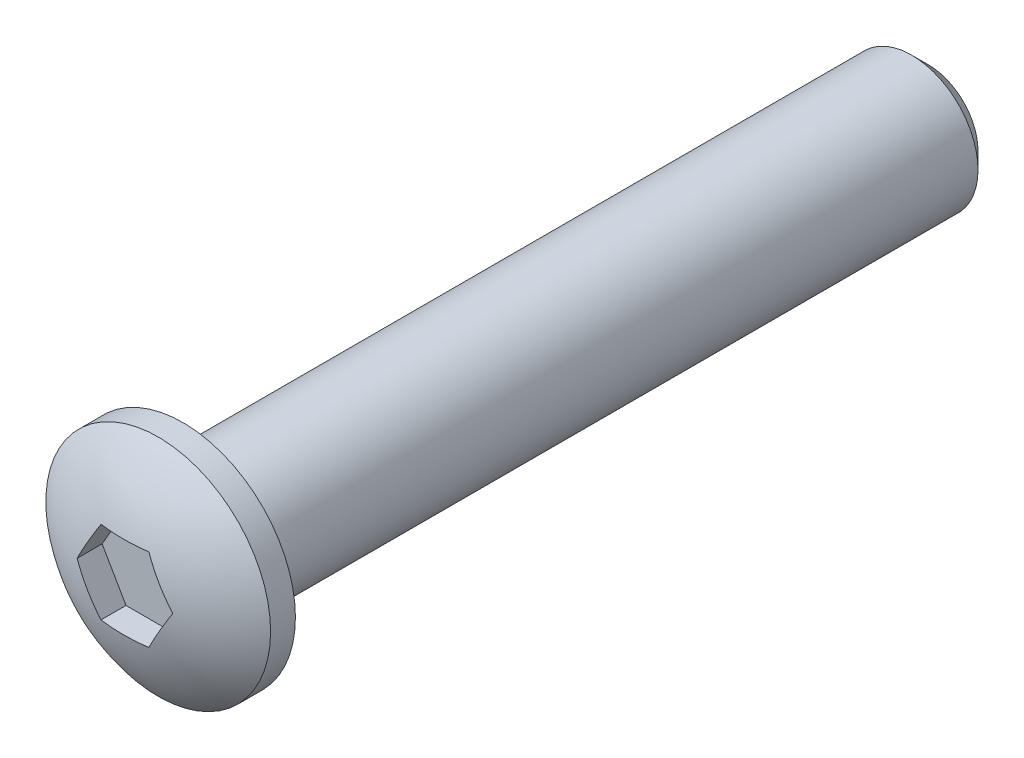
ISO-10303-21;
HEADER;
FILE_DESCRIPTION(('STEP AP214'),'2;1');
FILE_NAME('part.step','',(''),(''),'','','');
FILE_SCHEMA(('AUTOMOTIVE_DESIGN { 1 0 10303 214 1 1 1 1 }'));
ENDSEC;
DATA;
#1=APPLICATION_CONTEXT('core data for automotive mechanical design processes');
#2=APPLICATION_PROTOCOL_DEFINITION('international standard','automotive_design',2000,#1);
#3=PRODUCT_CONTEXT('',#1,'mechanical');
#4=PRODUCT('Part','Part','',(#3));
#5=PRODUCT_RELATED_PRODUCT_CATEGORY('part','',(#4));
#6=PRODUCT_DEFINITION_FORMATION('','',#4);
#7=PRODUCT_DEFINITION_CONTEXT('part definition',#1,'design');
#8=PRODUCT_DEFINITION('design','',#6,#7);
#9=PRODUCT_DEFINITION_SHAPE('','',#8);
#10=(LENGTH_UNIT() NAMED_UNIT(*) SI_UNIT(.MILLI.,.METRE.));
#11=(NAMED_UNIT(*) PLANE_ANGLE_UNIT() SI_UNIT($,.RADIAN.));
#12=(NAMED_UNIT(*) SI_UNIT($,.STERADIAN.) SOLID_ANGLE_UNIT());
#13=UNCERTAINTY_MEASURE_WITH_UNIT(LENGTH_MEASURE(1.E-05),#10,'distance_accuracy_value','');
#14=(GEOMETRIC_REPRESENTATION_CONTEXT(3) GLOBAL_UNCERTAINTY_ASSIGNED_CONTEXT((#13)) GLOBAL_UNIT_ASSIGNED_CONTEXT((#10,
#11,#12)) REPRESENTATION_CONTEXT('',''));
#15=CARTESIAN_POINT('',(0.,0.,0.));
#16=DIRECTION('',(0.,0.,1.));
#17=DIRECTION('',(1.,0.,0.));
#18=AXIS2_PLACEMENT_3D('',#15,#16,#17);
#19=CARTESIAN_POINT('',(0.,0.,-6.89088020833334));
#20=DIRECTION('',(0.,0.,1.));
#21=DIRECTION('',(1.,0.,0.));
#22=AXIS2_PLACEMENT_3D('',#19,#20,#21);
#23=SPHERICAL_SURFACE('',#22,10.7908802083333);
#24=CARTESIAN_POINT('',(0.,0.,1.5));
#25=DIRECTION('',(0.,0.,1.));
#26=DIRECTION('',(1.,0.,0.));
#27=AXIS2_PLACEMENT_3D('',#24,#25,#26);
#28=CIRCLE('',#27,6.785);
#29=CARTESIAN_POINT('',(6.785,0.,1.5));
#30=VERTEX_POINT('',#29);
#31=EDGE_CURVE('E126',#30,#30,#28,.T.);
#32=ORIENTED_EDGE('',*,*,#31,.T.);
#33=EDGE_LOOP('',(#32));
#34=FACE_BOUND('',#33,.T.);
#35=CARTESIAN_POINT('',(-2.16506350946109,-1.25,-6.89088020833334));
#36=DIRECTION('',(0.866025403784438,0.5,0.));
#37=DIRECTION('',(-0.5,0.866025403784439,0.));
#38=AXIS2_PLACEMENT_3D('',#35,#36,#37);
#39=CIRCLE('',#38,10.497289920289);
#40=CARTESIAN_POINT('',(-1.44337567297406,-2.5,3.50670423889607));
#41=VERTEX_POINT('',#40);
#42=CARTESIAN_POINT('',(-2.88675134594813,0.,3.50670423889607));
#43=VERTEX_POINT('',#42);
#44=EDGE_CURVE('E142',#41,#43,#39,.F.);
#45=ORIENTED_EDGE('',*,*,#44,.T.);
#46=CARTESIAN_POINT('',(-2.1650635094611,1.25,-6.89088020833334));
#47=DIRECTION('',(0.866025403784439,-0.499999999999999,0.));
#48=DIRECTION('',(0.499999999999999,0.866025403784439,0.));
#49=AXIS2_PLACEMENT_3D('',#46,#47,#48);
#50=CIRCLE('',#49,10.497289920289);
#51=CARTESIAN_POINT('',(-1.44337567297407,2.5,3.50670423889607));
#52=VERTEX_POINT('',#51);
#53=EDGE_CURVE('E53',#43,#52,#50,.F.);
#54=ORIENTED_EDGE('',*,*,#53,.T.);
#55=CARTESIAN_POINT('',(0.,2.5,-6.89088020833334));
#56=DIRECTION('',(0.,-1.,0.));
#57=DIRECTION('',(1.,0.,0.));
#58=AXIS2_PLACEMENT_3D('',#55,#56,#57);
#59=CIRCLE('',#58,10.497289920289);
#60=CARTESIAN_POINT('',(1.44337567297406,2.5,3.50670423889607));
#61=VERTEX_POINT('',#60);
#62=EDGE_CURVE('E125',#52,#61,#59,.F.);
#63=ORIENTED_EDGE('',*,*,#62,.T.);
#64=CARTESIAN_POINT('',(2.1650635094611,1.25,-6.89088020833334));
#65=DIRECTION('',(-0.866025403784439,-0.5,0.));
#66=DIRECTION('',(0.5,-0.866025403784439,0.));
#67=AXIS2_PLACEMENT_3D('',#64,#65,#66);
#68=CIRCLE('',#67,10.497289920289);
#69=CARTESIAN_POINT('',(2.88675134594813,0.,3.50670423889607));
#70=VERTEX_POINT('',#69);
#71=EDGE_CURVE('E133',#61,#70,#68,.F.);
#72=ORIENTED_EDGE('',*,*,#71,.T.);
#73=CARTESIAN_POINT('',(2.1650635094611,-1.25,-6.89088020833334));
#74=DIRECTION('',(-0.866025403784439,0.499999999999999,0.));
#75=DIRECTION('',(-0.499999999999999,-0.866025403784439,0.));
#76=AXIS2_PLACEMENT_3D('',#73,#74,#75);
#77=CIRCLE('',#76,10.497289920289);
#78=CARTESIAN_POINT('',(1.44337567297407,-2.5,3.50670423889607));
#79=VERTEX_POINT('',#78);
#80=EDGE_CURVE('E136',#70,#79,#77,.F.);
#81=ORIENTED_EDGE('',*,*,#80,.T.);
#82=CARTESIAN_POINT('',(0.,-2.5,-6.89088020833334));
#83=DIRECTION('',(0.,1.,0.));
#84=DIRECTION('',(0.,0.,1.));
#85=AXIS2_PLACEMENT_3D('',#82,#83,#84);
#86=CIRCLE('',#85,10.497289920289);
#87=EDGE_CURVE('E139',#79,#41,#86,.F.);
#88=ORIENTED_EDGE('',*,*,#87,.T.);
#89=EDGE_LOOP('',(#45,#54,#63,#72,#81,#88));
#90=FACE_BOUND('',#89,.T.);
#91=ADVANCED_FACE('F31',(#34,#90),#23,.T.);
#92=CARTESIAN_POINT('',(0.,0.,0.));
#93=DIRECTION('',(0.,0.,1.));
#94=DIRECTION('',(1.,0.,0.));
#95=AXIS2_PLACEMENT_3D('',#92,#93,#94);
#96=PLANE('',#95);
#97=CARTESIAN_POINT('',(0.,0.,0.));
#98=DIRECTION('',(0.,0.,1.));
#99=DIRECTION('',(1.,0.,0.));
#100=AXIS2_PLACEMENT_3D('',#97,#98,#99);
#101=CIRCLE('',#100,6.785);
#102=CARTESIAN_POINT('',(6.785,0.,0.));
#103=VERTEX_POINT('',#102);
#104=EDGE_CURVE('E89',#103,#103,#101,.T.);
#105=ORIENTED_EDGE('',*,*,#104,.F.);
#106=EDGE_LOOP('',(#105));
#107=FACE_BOUND('',#106,.T.);
#108=CARTESIAN_POINT('',(0.,0.,0.));
#109=DIRECTION('',(0.,0.,-1.));
#110=DIRECTION('',(-1.,0.,0.));
#111=AXIS2_PLACEMENT_3D('',#108,#109,#110);
#112=CIRCLE('',#111,4.);
#113=CARTESIAN_POINT('',(4.,0.,0.));
#114=VERTEX_POINT('',#113);
#115=EDGE_CURVE('E122',#114,#114,#112,.T.);
#116=ORIENTED_EDGE('',*,*,#115,.F.);
#117=EDGE_LOOP('',(#116));
#118=FACE_BOUND('',#117,.T.);
#119=ADVANCED_FACE('F160',(#107,#118),#96,.F.);
#120=CARTESIAN_POINT('',(0.,0.,1.5));
#121=DIRECTION('',(0.,0.,-1.));
#122=DIRECTION('',(-1.,0.,0.));
#123=AXIS2_PLACEMENT_3D('',#120,#121,#122);
#124=CYLINDRICAL_SURFACE('',#123,6.785);
#125=ORIENTED_EDGE('',*,*,#31,.F.);
#126=EDGE_LOOP('',(#125));
#127=FACE_BOUND('',#126,.T.);
#128=ORIENTED_EDGE('',*,*,#104,.T.);
#129=EDGE_LOOP('',(#128));
#130=FACE_BOUND('',#129,.T.);
#131=ADVANCED_FACE('F165',(#127,#130),#124,.T.);
#132=CARTESIAN_POINT('',(0.,0.,-45.));
#133=DIRECTION('',(0.,0.,1.));
#134=DIRECTION('',(1.,0.,0.));
#135=AXIS2_PLACEMENT_3D('',#132,#133,#134);
#136=CYLINDRICAL_SURFACE('',#135,4.);
#137=CARTESIAN_POINT('',(0.,0.,-44.));
#138=DIRECTION('',(0.,0.,-1.));
#139=DIRECTION('',(-1.,0.,0.));
#140=AXIS2_PLACEMENT_3D('',#137,#138,#139);
#141=CIRCLE('',#140,4.);
#142=CARTESIAN_POINT('',(4.,0.,-44.));
#143=VERTEX_POINT('',#142);
#144=EDGE_CURVE('E11',#143,#143,#141,.F.);
#145=CARTESIAN_POINT('',(4.,0.,-44.));
#146=CARTESIAN_POINT('',(4.,0.,-43.5416666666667));
#147=CARTESIAN_POINT('',(4.,0.,-43.0833333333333));
#148=CARTESIAN_POINT('',(4.,0.,-42.1666666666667));
#149=CARTESIAN_POINT('',(4.,0.,-41.7083333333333));
#150=CARTESIAN_POINT('',(4.,0.,-40.7916666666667));
#151=CARTESIAN_POINT('',(4.,0.,-40.3333333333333));
#152=CARTESIAN_POINT('',(4.,0.,-39.4166666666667));
#153=CARTESIAN_POINT('',(4.,0.,-38.9583333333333));
#154=CARTESIAN_POINT('',(4.,0.,-38.0416666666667));
#155=CARTESIAN_POINT('',(4.,0.,-37.5833333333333));
#156=CARTESIAN_POINT('',(4.,0.,-36.6666666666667));
#157=CARTESIAN_POINT('',(4.,0.,-36.2083333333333));
#158=CARTESIAN_POINT('',(4.,0.,-35.2916666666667));
#159=CARTESIAN_POINT('',(4.,0.,-34.8333333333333));
#160=CARTESIAN_POINT('',(4.,0.,-33.9166666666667));
#161=CARTESIAN_POINT('',(4.,0.,-33.4583333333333));
#162=CARTESIAN_POINT('',(4.,0.,-32.5416666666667));
#163=CARTESIAN_POINT('',(4.,0.,-32.0833333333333));
#164=CARTESIAN_POINT('',(4.,0.,-31.1666666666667));
#165=CARTESIAN_POINT('',(4.,0.,-30.7083333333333));
#166=CARTESIAN_POINT('',(4.,0.,-29.7916666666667));
#167=CARTESIAN_POINT('',(4.,0.,-29.3333333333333));
#168=CARTESIAN_POINT('',(4.,0.,-28.4166666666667));
#169=CARTESIAN_POINT('',(4.,0.,-27.9583333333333));
#170=CARTESIAN_POINT('',(4.,0.,-27.0416666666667));
#171=CARTESIAN_POINT('',(4.,0.,-26.5833333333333));
#172=CARTESIAN_POINT('',(4.,0.,-25.6666666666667));
#173=CARTESIAN_POINT('',(4.,0.,-25.2083333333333));
#174=CARTESIAN_POINT('',(4.,0.,-24.2916666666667));
#175=CARTESIAN_POINT('',(4.,0.,-23.8333333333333));
#176=CARTESIAN_POINT('',(4.,0.,-22.9166666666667));
#177=CARTESIAN_POINT('',(4.,0.,-22.4583333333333));
#178=CARTESIAN_POINT('',(4.,0.,-21.5416666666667));
#179=CARTESIAN_POINT('',(4.,0.,-21.0833333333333));
#180=CARTESIAN_POINT('',(4.,0.,-20.1666666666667));
#181=CARTESIAN_POINT('',(4.,0.,-19.7083333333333));
#182=CARTESIAN_POINT('',(4.,0.,-18.7916666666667));
#183=CARTESIAN_POINT('',(4.,0.,-18.3333333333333));
#184=CARTESIAN_POINT('',(4.,0.,-17.4166666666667));
#185=CARTESIAN_POINT('',(4.,0.,-16.9583333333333));
#186=CARTESIAN_POINT('',(4.,0.,-16.0416666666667));
#187=CARTESIAN_POINT('',(4.,0.,-15.5833333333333));
#188=CARTESIAN_POINT('',(4.,0.,-14.6666666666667));
#189=CARTESIAN_POINT('',(4.,0.,-14.2083333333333));
#190=CARTESIAN_POINT('',(4.,0.,-13.2916666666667));
#191=CARTESIAN_POINT('',(4.,0.,-12.8333333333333));
#192=CARTESIAN_POINT('',(4.,0.,-11.9166666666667));
#193=CARTESIAN_POINT('',(4.,0.,-11.4583333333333));
#194=CARTESIAN_POINT('',(4.,0.,-10.5416666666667));
#195=CARTESIAN_POINT('',(4.,0.,-10.0833333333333));
#196=CARTESIAN_POINT('',(4.,0.,-9.16666666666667));
#197=CARTESIAN_POINT('',(4.,0.,-8.70833333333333));
#198=CARTESIAN_POINT('',(4.,0.,-7.79166666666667));
#199=CARTESIAN_POINT('',(4.,0.,-7.33333333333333));
#200=CARTESIAN_POINT('',(4.,0.,-6.41666666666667));
#201=CARTESIAN_POINT('',(4.,0.,-5.95833333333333));
#202=CARTESIAN_POINT('',(4.,0.,-5.04166666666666));
#203=CARTESIAN_POINT('',(4.,0.,-4.58333333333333));
#204=CARTESIAN_POINT('',(4.,0.,-3.66666666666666));
#205=CARTESIAN_POINT('',(4.,0.,-3.20833333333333));
#206=CARTESIAN_POINT('',(4.,0.,-2.29166666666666));
#207=CARTESIAN_POINT('',(4.,0.,-1.83333333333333));
#208=CARTESIAN_POINT('',(4.,0.,-0.916666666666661));
#209=CARTESIAN_POINT('',(4.,0.,-0.458333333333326));
#210=CARTESIAN_POINT('',(4.,0.,0.));
#211=B_SPLINE_CURVE_WITH_KNOTS('',3,(#145,#146,#147,#148,#149,#150,#151,#152,#153,#154,#155,
#156,#157,#158,#159,#160,#161,#162,#163,#164,#165,#166,#167,#168,#169,#170,#171,#172,#173,#174,
#175,#176,#177,#178,#179,#180,#181,#182,#183,#184,#185,#186,#187,#188,#189,#190,#191,#192,#193,
#194,#195,#196,#197,#198,#199,#200,#201,#202,#203,#204,#205,#206,#207,#208,#209,#210),
.UNSPECIFIED.,.F.,.F.,(4,2,2,2,2,2,2,2,2,2,2,2,2,2,2,2,2,2,2,2,2,2,2,2,2,2,2,2,2,2,2,2,4),(0.,
1.375,2.75,4.125,5.50000000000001,6.875,8.25,9.625,11.,12.375,13.75,15.125,16.5,17.875,19.25,
20.625,22.,23.375,24.75,26.125,27.5,28.875,30.25,31.625,33.,34.375,35.75,37.125,38.5,39.875,
41.25,42.625,44.),.UNSPECIFIED.);
#212=EDGE_CURVE('BSEAM197',#143,#114,#211,.T.);
#213=ORIENTED_EDGE('',*,*,#144,.T.);
#214=ORIENTED_EDGE('',*,*,#115,.T.);
#215=ORIENTED_EDGE('',*,*,#212,.T.);
#216=ORIENTED_EDGE('',*,*,#212,.F.);
#217=EDGE_LOOP('',(#213,#215,#214,#216));
#218=FACE_BOUND('',#217,.T.);
#219=ADVANCED_FACE('F197',(#218),#136,.T.);
#220=CARTESIAN_POINT('',(0.,0.,-45.));
#221=DIRECTION('',(0.,0.,-1.));
#222=DIRECTION('',(-1.,0.,0.));
#223=AXIS2_PLACEMENT_3D('',#220,#221,#222);
#224=PLANE('',#223);
#225=CARTESIAN_POINT('',(0.,0.,-45.));
#226=DIRECTION('',(0.,0.,-1.));
#227=DIRECTION('',(-1.,0.,0.));
#228=AXIS2_PLACEMENT_3D('',#225,#226,#227);
#229=CIRCLE('',#228,2.99999999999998);
#230=CARTESIAN_POINT('',(-2.99999999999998,0.,-45.));
#231=VERTEX_POINT('',#230);
#232=EDGE_CURVE('E38',#231,#231,#229,.T.);
#233=ORIENTED_EDGE('',*,*,#232,.T.);
#234=EDGE_LOOP('',(#233));
#235=FACE_BOUND('',#234,.T.);
#236=ADVANCED_FACE('F147',(#235),#224,.T.);
#237=CARTESIAN_POINT('',(-2.88675134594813,0.,6.));
#238=DIRECTION('',(0.866025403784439,-0.499999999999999,0.));
#239=DIRECTION('',(0.499999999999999,0.866025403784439,0.));
#240=AXIS2_PLACEMENT_3D('',#237,#238,#239);
#241=PLANE('',#240);
#242=DIRECTION('',(0.,0.,-1.));
#243=VECTOR('',#242,1.);
#244=CARTESIAN_POINT('',(-2.88675134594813,0.,6.));
#245=LINE('',#244,#243);
#246=CARTESIAN_POINT('',(-2.88675134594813,0.,2.));
#247=VERTEX_POINT('',#246);
#248=EDGE_CURVE('E82',#43,#247,#245,.T.);
#249=ORIENTED_EDGE('',*,*,#248,.T.);
#250=DIRECTION('',(-0.499999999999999,-0.866025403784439,0.));
#251=VECTOR('',#250,1.);
#252=CARTESIAN_POINT('',(-2.88675134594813,0.,2.));
#253=LINE('',#252,#251);
#254=CARTESIAN_POINT('',(-1.44337567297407,2.5,2.));
#255=VERTEX_POINT('',#254);
#256=EDGE_CURVE('E86',#255,#247,#253,.T.);
#257=ORIENTED_EDGE('',*,*,#256,.F.);
#258=DIRECTION('',(0.,0.,-1.));
#259=VECTOR('',#258,1.);
#260=CARTESIAN_POINT('',(-1.44337567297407,2.5,6.));
#261=LINE('',#260,#259);
#262=EDGE_CURVE('E114',#52,#255,#261,.T.);
#263=ORIENTED_EDGE('',*,*,#262,.F.);
#264=ORIENTED_EDGE('',*,*,#53,.F.);
#265=EDGE_LOOP('',(#249,#257,#263,#264));
#266=FACE_BOUND('',#265,.T.);
#267=ADVANCED_FACE('F84',(#266),#241,.T.);
#268=CARTESIAN_POINT('',(-1.44337567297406,-2.5,6.));
#269=DIRECTION('',(0.866025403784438,0.5,0.));
#270=DIRECTION('',(-0.5,0.866025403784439,0.));
#271=AXIS2_PLACEMENT_3D('',#268,#269,#270);
#272=PLANE('',#271);
#273=DIRECTION('',(0.,0.,-1.));
#274=VECTOR('',#273,1.);
#275=CARTESIAN_POINT('',(-1.44337567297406,-2.5,6.));
#276=LINE('',#275,#274);
#277=CARTESIAN_POINT('',(-1.44337567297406,-2.5,2.));
#278=VERTEX_POINT('',#277);
#279=EDGE_CURVE('E90',#41,#278,#276,.T.);
#280=ORIENTED_EDGE('',*,*,#279,.T.);
#281=DIRECTION('',(0.5,-0.866025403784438,0.));
#282=VECTOR('',#281,1.);
#283=CARTESIAN_POINT('',(-1.44337567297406,-2.5,2.));
#284=LINE('',#283,#282);
#285=EDGE_CURVE('E93',#247,#278,#284,.T.);
#286=ORIENTED_EDGE('',*,*,#285,.F.);
#287=ORIENTED_EDGE('',*,*,#248,.F.);
#288=ORIENTED_EDGE('',*,*,#44,.F.);
#289=EDGE_LOOP('',(#280,#286,#287,#288));
#290=FACE_BOUND('',#289,.T.);
#291=ADVANCED_FACE('F94',(#290),#272,.T.);
#292=CARTESIAN_POINT('',(1.44337567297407,-2.5,6.));
#293=DIRECTION('',(0.,1.,0.));
#294=DIRECTION('',(0.,0.,1.));
#295=AXIS2_PLACEMENT_3D('',#292,#293,#294);
#296=PLANE('',#295);
#297=DIRECTION('',(0.,0.,-1.));
#298=VECTOR('',#297,1.);
#299=CARTESIAN_POINT('',(1.44337567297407,-2.5,6.));
#300=LINE('',#299,#298);
#301=CARTESIAN_POINT('',(1.44337567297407,-2.5,2.));
#302=VERTEX_POINT('',#301);
#303=EDGE_CURVE('E119',#79,#302,#300,.T.);
#304=ORIENTED_EDGE('',*,*,#303,.T.);
#305=DIRECTION('',(1.,0.,0.));
#306=VECTOR('',#305,1.);
#307=CARTESIAN_POINT('',(1.44337567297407,-2.5,2.));
#308=LINE('',#307,#306);
#309=EDGE_CURVE('E99',#278,#302,#308,.T.);
#310=ORIENTED_EDGE('',*,*,#309,.F.);
#311=ORIENTED_EDGE('',*,*,#279,.F.);
#312=ORIENTED_EDGE('',*,*,#87,.F.);
#313=EDGE_LOOP('',(#304,#310,#311,#312));
#314=FACE_BOUND('',#313,.T.);
#315=ADVANCED_FACE('F171',(#314),#296,.T.);
#316=CARTESIAN_POINT('',(2.88675134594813,0.,6.));
#317=DIRECTION('',(-0.866025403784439,0.499999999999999,0.));
#318=DIRECTION('',(-0.499999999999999,-0.866025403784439,0.));
#319=AXIS2_PLACEMENT_3D('',#316,#317,#318);
#320=PLANE('',#319);
#321=DIRECTION('',(0.,0.,-1.));
#322=VECTOR('',#321,1.);
#323=CARTESIAN_POINT('',(2.88675134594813,0.,6.));
#324=LINE('',#323,#322);
#325=CARTESIAN_POINT('',(2.88675134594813,0.,2.));
#326=VERTEX_POINT('',#325);
#327=EDGE_CURVE('E117',#70,#326,#324,.T.);
#328=ORIENTED_EDGE('',*,*,#327,.T.);
#329=DIRECTION('',(0.499999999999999,0.866025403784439,0.));
#330=VECTOR('',#329,1.);
#331=CARTESIAN_POINT('',(2.88675134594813,0.,2.));
#332=LINE('',#331,#330);
#333=EDGE_CURVE('E108',#302,#326,#332,.T.);
#334=ORIENTED_EDGE('',*,*,#333,.F.);
#335=ORIENTED_EDGE('',*,*,#303,.F.);
#336=ORIENTED_EDGE('',*,*,#80,.F.);
#337=EDGE_LOOP('',(#328,#334,#335,#336));
#338=FACE_BOUND('',#337,.T.);
#339=ADVANCED_FACE('F176',(#338),#320,.T.);
#340=CARTESIAN_POINT('',(1.44337567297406,2.5,6.));
#341=DIRECTION('',(-0.866025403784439,-0.5,0.));
#342=DIRECTION('',(0.5,-0.866025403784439,0.));
#343=AXIS2_PLACEMENT_3D('',#340,#341,#342);
#344=PLANE('',#343);
#345=DIRECTION('',(0.,0.,-1.));
#346=VECTOR('',#345,1.);
#347=CARTESIAN_POINT('',(1.44337567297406,2.5,6.));
#348=LINE('',#347,#346);
#349=CARTESIAN_POINT('',(1.44337567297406,2.5,2.));
#350=VERTEX_POINT('',#349);
#351=EDGE_CURVE('E45',#61,#350,#348,.T.);
#352=ORIENTED_EDGE('',*,*,#351,.T.);
#353=DIRECTION('',(-0.5,0.866025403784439,0.));
#354=VECTOR('',#353,1.);
#355=CARTESIAN_POINT('',(1.44337567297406,2.5,2.));
#356=LINE('',#355,#354);
#357=EDGE_CURVE('E111',#326,#350,#356,.T.);
#358=ORIENTED_EDGE('',*,*,#357,.F.);
#359=ORIENTED_EDGE('',*,*,#327,.F.);
#360=ORIENTED_EDGE('',*,*,#71,.F.);
#361=EDGE_LOOP('',(#352,#358,#359,#360));
#362=FACE_BOUND('',#361,.T.);
#363=ADVANCED_FACE('F179',(#362),#344,.T.);
#364=CARTESIAN_POINT('',(-1.44337567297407,2.5,6.));
#365=DIRECTION('',(0.,-1.,0.));
#366=DIRECTION('',(1.,0.,0.));
#367=AXIS2_PLACEMENT_3D('',#364,#365,#366);
#368=PLANE('',#367);
#369=ORIENTED_EDGE('',*,*,#262,.T.);
#370=DIRECTION('',(-1.,0.,0.));
#371=VECTOR('',#370,1.);
#372=CARTESIAN_POINT('',(-1.44337567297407,2.5,2.));
#373=LINE('',#372,#371);
#374=EDGE_CURVE('E104',#350,#255,#373,.T.);
#375=ORIENTED_EDGE('',*,*,#374,.F.);
#376=ORIENTED_EDGE('',*,*,#351,.F.);
#377=ORIENTED_EDGE('',*,*,#62,.F.);
#378=EDGE_LOOP('',(#369,#375,#376,#377));
#379=FACE_BOUND('',#378,.T.);
#380=ADVANCED_FACE('F156',(#379),#368,.T.);
#381=CARTESIAN_POINT('',(-4.33012701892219,-2.5,2.));
#382=DIRECTION('',(0.,0.,1.));
#383=DIRECTION('',(1.,0.,0.));
#384=AXIS2_PLACEMENT_3D('',#381,#382,#383);
#385=PLANE('',#384);
#386=ORIENTED_EDGE('',*,*,#256,.T.);
#387=ORIENTED_EDGE('',*,*,#285,.T.);
#388=ORIENTED_EDGE('',*,*,#309,.T.);
#389=ORIENTED_EDGE('',*,*,#333,.T.);
#390=ORIENTED_EDGE('',*,*,#357,.T.);
#391=ORIENTED_EDGE('',*,*,#374,.T.);
#392=EDGE_LOOP('',(#386,#387,#388,#389,#390,#391));
#393=FACE_BOUND('',#392,.T.);
#394=ADVANCED_FACE('F102',(#393),#385,.T.);
#395=CARTESIAN_POINT('',(0.,0.,-45.));
#396=DIRECTION('',(0.,0.,1.));
#397=DIRECTION('',(1.,0.,0.));
#398=AXIS2_PLACEMENT_3D('',#395,#396,#397);
#399=CONICAL_SURFACE('',#398,2.99999999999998,0.785398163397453);
#400=ORIENTED_EDGE('',*,*,#144,.F.);
#401=EDGE_LOOP('',(#400));
#402=FACE_BOUND('',#401,.T.);
#403=ORIENTED_EDGE('',*,*,#232,.F.);
#404=EDGE_LOOP('',(#403));
#405=FACE_BOUND('',#404,.T.);
#406=ADVANCED_FACE('F149',(#402,#405),#399,.T.);
#407=CLOSED_SHELL('',(#91,#119,#131,#219,#236,#267,#291,#315,#339,#363,#380,#394,#406));
#408=MANIFOLD_SOLID_BREP('B2',#407);
#409=ADVANCED_BREP_SHAPE_REPRESENTATION('',(#18,#408),#14);
#410=SHAPE_DEFINITION_REPRESENTATION(#9,#409);
ENDSEC;
END-ISO-10303-21;
